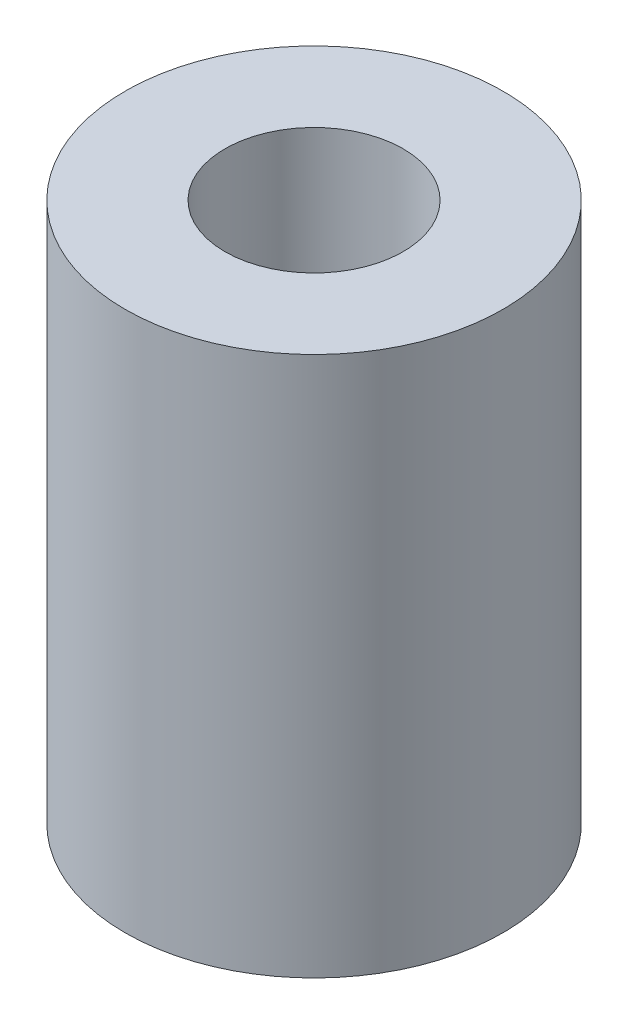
ISO-10303-21;
HEADER;
FILE_DESCRIPTION(('STEP AP214'),'2;1');
FILE_NAME('part.step','',(''),(''),'','','');
FILE_SCHEMA(('AUTOMOTIVE_DESIGN { 1 0 10303 214 1 1 1 1 }'));
ENDSEC;
DATA;
#1=APPLICATION_CONTEXT('core data for automotive mechanical design processes');
#2=APPLICATION_PROTOCOL_DEFINITION('international standard','automotive_design',2000,#1);
#3=PRODUCT_CONTEXT('',#1,'mechanical');
#4=PRODUCT('Part','Part','',(#3));
#5=PRODUCT_RELATED_PRODUCT_CATEGORY('part','',(#4));
#6=PRODUCT_DEFINITION_FORMATION('','',#4);
#7=PRODUCT_DEFINITION_CONTEXT('part definition',#1,'design');
#8=PRODUCT_DEFINITION('design','',#6,#7);
#9=PRODUCT_DEFINITION_SHAPE('','',#8);
#10=(LENGTH_UNIT() NAMED_UNIT(*) SI_UNIT(.MILLI.,.METRE.));
#11=(NAMED_UNIT(*) PLANE_ANGLE_UNIT() SI_UNIT($,.RADIAN.));
#12=(NAMED_UNIT(*) SI_UNIT($,.STERADIAN.) SOLID_ANGLE_UNIT());
#13=UNCERTAINTY_MEASURE_WITH_UNIT(LENGTH_MEASURE(1.E-05),#10,'distance_accuracy_value','');
#14=(GEOMETRIC_REPRESENTATION_CONTEXT(3) GLOBAL_UNCERTAINTY_ASSIGNED_CONTEXT((#13)) GLOBAL_UNIT_ASSIGNED_CONTEXT((#10,
#11,#12)) REPRESENTATION_CONTEXT('',''));
#15=CARTESIAN_POINT('',(0.,0.,0.));
#16=DIRECTION('',(0.,0.,1.));
#17=DIRECTION('',(1.,0.,0.));
#18=AXIS2_PLACEMENT_3D('',#15,#16,#17);
#19=CARTESIAN_POINT('',(0.,0.,0.));
#20=DIRECTION('',(0.,1.,0.));
#21=DIRECTION('',(0.,0.,1.));
#22=AXIS2_PLACEMENT_3D('',#19,#20,#21);
#23=PLANE('',#22);
#24=CARTESIAN_POINT('',(0.,0.,0.));
#25=DIRECTION('',(0.,1.,0.));
#26=DIRECTION('',(0.,0.,1.));
#27=AXIS2_PLACEMENT_3D('',#24,#25,#26);
#28=CIRCLE('',#27,7.);
#29=CARTESIAN_POINT('',(0.,0.,7.));
#30=VERTEX_POINT('',#29);
#31=EDGE_CURVE('E155',#30,#30,#28,.T.);
#32=ORIENTED_EDGE('',*,*,#31,.F.);
#33=EDGE_LOOP('',(#32));
#34=FACE_BOUND('',#33,.T.);
#35=CARTESIAN_POINT('',(0.,0.,0.));
#36=DIRECTION('',(0.,1.,0.));
#37=DIRECTION('',(0.,0.,1.));
#38=AXIS2_PLACEMENT_3D('',#35,#36,#37);
#39=CIRCLE('',#38,4.064);
#40=CARTESIAN_POINT('',(-3.06646490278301,0.,-2.667));
#41=VERTEX_POINT('',#40);
#42=CARTESIAN_POINT('',(3.06646490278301,0.,-2.667));
#43=VERTEX_POINT('',#42);
#44=EDGE_CURVE('E144',#41,#43,#39,.T.);
#45=ORIENTED_EDGE('',*,*,#44,.T.);
#46=DIRECTION('',(-1.,0.,0.));
#47=VECTOR('',#46,1.);
#48=CARTESIAN_POINT('',(-3.06646490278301,0.,-2.667));
#49=LINE('',#48,#47);
#50=EDGE_CURVE('E147',#43,#41,#49,.T.);
#51=ORIENTED_EDGE('',*,*,#50,.T.);
#52=EDGE_LOOP('',(#45,#51));
#53=FACE_BOUND('',#52,.T.);
#54=ADVANCED_FACE('F36',(#34,#53),#23,.F.);
#55=CARTESIAN_POINT('',(0.,10.,0.));
#56=DIRECTION('',(0.,-1.,0.));
#57=DIRECTION('',(0.,0.,-1.));
#58=AXIS2_PLACEMENT_3D('',#55,#56,#57);
#59=CYLINDRICAL_SURFACE('',#58,7.);
#60=ORIENTED_EDGE('',*,*,#31,.T.);
#61=EDGE_LOOP('',(#60));
#62=FACE_BOUND('',#61,.T.);
#63=CARTESIAN_POINT('',(0.,20.,0.));
#64=DIRECTION('',(0.,1.,0.));
#65=DIRECTION('',(0.,0.,1.));
#66=AXIS2_PLACEMENT_3D('',#63,#64,#65);
#67=CIRCLE('',#66,7.);
#68=CARTESIAN_POINT('',(0.,20.,7.));
#69=VERTEX_POINT('',#68);
#70=EDGE_CURVE('E244',#69,#69,#67,.T.);
#71=ORIENTED_EDGE('',*,*,#70,.F.);
#72=EDGE_LOOP('',(#71));
#73=FACE_BOUND('',#72,.T.);
#74=ADVANCED_FACE('F232',(#62,#73),#59,.T.);
#75=CARTESIAN_POINT('',(0.,10.,0.));
#76=DIRECTION('',(0.,-1.,0.));
#77=DIRECTION('',(0.,0.,-1.));
#78=AXIS2_PLACEMENT_3D('',#75,#76,#77);
#79=CYLINDRICAL_SURFACE('',#78,4.064);
#80=DIRECTION('',(0.,-1.,0.));
#81=VECTOR('',#80,1.);
#82=CARTESIAN_POINT('',(-3.06646490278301,10.,-2.667));
#83=LINE('',#82,#81);
#84=CARTESIAN_POINT('',(-3.06646490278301,8.,-2.667));
#85=VERTEX_POINT('',#84);
#86=EDGE_CURVE('E151',#85,#41,#83,.T.);
#87=ORIENTED_EDGE('',*,*,#86,.F.);
#88=CARTESIAN_POINT('',(0.,8.,0.));
#89=DIRECTION('',(0.,1.,0.));
#90=DIRECTION('',(0.,0.,1.));
#91=AXIS2_PLACEMENT_3D('',#88,#89,#90);
#92=CIRCLE('',#91,4.064);
#93=CARTESIAN_POINT('',(3.06646490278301,8.,-2.667));
#94=VERTEX_POINT('',#93);
#95=EDGE_CURVE('E166',#85,#94,#92,.T.);
#96=ORIENTED_EDGE('',*,*,#95,.T.);
#97=DIRECTION('',(0.,-1.,0.));
#98=VECTOR('',#97,1.);
#99=CARTESIAN_POINT('',(3.06646490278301,10.,-2.667));
#100=LINE('',#99,#98);
#101=EDGE_CURVE('E153',#94,#43,#100,.T.);
#102=ORIENTED_EDGE('',*,*,#101,.T.);
#103=ORIENTED_EDGE('',*,*,#44,.F.);
#104=EDGE_LOOP('',(#87,#96,#102,#103));
#105=FACE_BOUND('',#104,.T.);
#106=ADVANCED_FACE('F228',(#105),#79,.F.);
#107=CARTESIAN_POINT('',(-3.06646490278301,10.,-2.667));
#108=DIRECTION('',(0.,0.,1.));
#109=DIRECTION('',(1.,0.,0.));
#110=AXIS2_PLACEMENT_3D('',#107,#108,#109);
#111=PLANE('',#110);
#112=ORIENTED_EDGE('',*,*,#101,.F.);
#113=DIRECTION('',(-1.,0.,0.));
#114=VECTOR('',#113,1.);
#115=CARTESIAN_POINT('',(-3.06646490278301,8.,-2.667));
#116=LINE('',#115,#114);
#117=EDGE_CURVE('E158',#94,#85,#116,.T.);
#118=ORIENTED_EDGE('',*,*,#117,.T.);
#119=ORIENTED_EDGE('',*,*,#86,.T.);
#120=ORIENTED_EDGE('',*,*,#50,.F.);
#121=EDGE_LOOP('',(#112,#118,#119,#120));
#122=FACE_BOUND('',#121,.T.);
#123=ADVANCED_FACE('F224',(#122),#111,.T.);
#124=CARTESIAN_POINT('',(0.,10.,0.));
#125=DIRECTION('',(0.,1.,0.));
#126=DIRECTION('',(0.,0.,1.));
#127=AXIS2_PLACEMENT_3D('',#124,#125,#126);
#128=PLANE('',#127);
#129=CARTESIAN_POINT('',(0.,10.,0.));
#130=DIRECTION('',(0.,1.,0.));
#131=DIRECTION('',(0.,0.,1.));
#132=AXIS2_PLACEMENT_3D('',#129,#130,#131);
#133=CIRCLE('',#132,2.064);
#134=CARTESIAN_POINT('',(1.95325548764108,10.,-0.667));
#135=VERTEX_POINT('',#134);
#136=CARTESIAN_POINT('',(-1.95325548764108,10.,-0.667));
#137=VERTEX_POINT('',#136);
#138=EDGE_CURVE('E161',#135,#137,#133,.F.);
#139=ORIENTED_EDGE('',*,*,#138,.T.);
#140=DIRECTION('',(-1.,0.,0.));
#141=VECTOR('',#140,1.);
#142=CARTESIAN_POINT('',(0.,10.,-0.667));
#143=LINE('',#142,#141);
#144=EDGE_CURVE('E163',#137,#135,#143,.F.);
#145=ORIENTED_EDGE('',*,*,#144,.T.);
#146=EDGE_LOOP('',(#139,#145));
#147=FACE_BOUND('',#146,.T.);
#148=ADVANCED_FACE('F187',(#147),#128,.F.);
#149=CARTESIAN_POINT('',(0.,8.,0.));
#150=DIRECTION('',(0.,1.,0.));
#151=DIRECTION('',(0.,0.,1.));
#152=AXIS2_PLACEMENT_3D('',#149,#150,#151);
#153=TOROIDAL_SURFACE('',#152,2.064,2.);
#154=CARTESIAN_POINT('',(-3.06646490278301,8.,-2.667));
#155=CARTESIAN_POINT('',(-3.06646657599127,8.0523151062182,-2.66700760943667));
#156=CARTESIAN_POINT('',(-3.06552978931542,8.10462654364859,-2.6649474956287));
#157=CARTESIAN_POINT('',(-3.06179273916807,8.20885237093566,-2.65674995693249));
#158=CARTESIAN_POINT('',(-3.05899282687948,8.26076683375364,-2.65061330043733));
#159=CARTESIAN_POINT('',(-3.05155291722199,8.36369124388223,-2.63434254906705));
#160=CARTESIAN_POINT('',(-3.04691785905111,8.41470323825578,-2.62421918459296));
#161=CARTESIAN_POINT('',(-3.03583758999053,8.51558776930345,-2.60009682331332));
#162=CARTESIAN_POINT('',(-3.02939235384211,8.56546029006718,-2.58609777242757));
#163=CARTESIAN_POINT('',(-3.00738943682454,8.71282577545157,-2.53849792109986));
#164=CARTESIAN_POINT('',(-2.98915623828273,8.80818149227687,-2.49927595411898));
#165=CARTESIAN_POINT('',(-2.94594791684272,8.99051844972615,-2.40749307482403));
#166=CARTESIAN_POINT('',(-2.92097056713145,9.07749691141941,-2.35492775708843));
#167=CARTESIAN_POINT('',(-2.8639091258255,9.24358596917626,-2.23676810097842));
#168=CARTESIAN_POINT('',(-2.83164001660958,9.32239541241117,-2.17084025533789));
#169=CARTESIAN_POINT('',(-2.76098824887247,9.46768550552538,-2.02942010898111));
#170=CARTESIAN_POINT('',(-2.7226043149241,9.53416357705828,-1.95392581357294));
#171=CARTESIAN_POINT('',(-2.63699021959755,9.65868148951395,-1.78959729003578));
#172=CARTESIAN_POINT('',(-2.58929979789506,9.71563322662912,-1.70017988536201));
#173=CARTESIAN_POINT('',(-2.48802860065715,9.81379310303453,-1.51614575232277));
#174=CARTESIAN_POINT('',(-2.43444279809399,9.85498766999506,-1.42152462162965));
#175=CARTESIAN_POINT('',(-2.314625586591,9.92614291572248,-1.21755209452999));
#176=CARTESIAN_POINT('',(-2.24765597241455,9.95394490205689,-1.10788580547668));
#177=CARTESIAN_POINT('',(-2.10759174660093,9.99065077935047,-0.889563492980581));
#178=CARTESIAN_POINT('',(-2.03450784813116,9.99958703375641,-0.780906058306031));
#179=CARTESIAN_POINT('',(-1.95681961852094,9.99999535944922,-0.671986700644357));
#180=CARTESIAN_POINT('',(-1.95503832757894,10.0000000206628,-0.669492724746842));
#181=CARTESIAN_POINT('',(-1.95325548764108,10.,-0.667));
#182=B_SPLINE_CURVE_WITH_KNOTS('',3,(#154,#155,#156,#157,#158,#159,#160,#161,#162,#163,#164,
#165,#166,#167,#168,#169,#170,#171,#172,#173,#174,#175,#176,#177,#178,#179,#180,#181),
.UNSPECIFIED.,.F.,.F.,(4,2,2,2,2,2,2,2,2,2,2,2,2,4),(0.,0.156890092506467,0.313750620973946,
0.470191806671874,0.626635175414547,0.939176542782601,1.25182123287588,1.57352864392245,
1.89530324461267,2.24260991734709,2.59021507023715,2.98304213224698,3.37519476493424,
3.38438911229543),.UNSPECIFIED.);
#183=EDGE_CURVE('E138',#137,#85,#182,.F.);
#184=ORIENTED_EDGE('',*,*,#183,.F.);
#185=ORIENTED_EDGE('',*,*,#138,.F.);
#186=CARTESIAN_POINT('',(3.06646490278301,8.,-2.667));
#187=CARTESIAN_POINT('',(3.06646657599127,8.0523151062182,-2.66700760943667));
#188=CARTESIAN_POINT('',(3.06552978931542,8.10462654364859,-2.6649474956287));
#189=CARTESIAN_POINT('',(3.06179273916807,8.20885237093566,-2.65674995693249));
#190=CARTESIAN_POINT('',(3.05899282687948,8.26076683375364,-2.65061330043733));
#191=CARTESIAN_POINT('',(3.05155291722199,8.36369124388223,-2.63434254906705));
#192=CARTESIAN_POINT('',(3.04691785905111,8.41470323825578,-2.62421918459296));
#193=CARTESIAN_POINT('',(3.03583758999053,8.51558776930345,-2.60009682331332));
#194=CARTESIAN_POINT('',(3.02939235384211,8.56546029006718,-2.58609777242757));
#195=CARTESIAN_POINT('',(3.00738943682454,8.71282577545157,-2.53849792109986));
#196=CARTESIAN_POINT('',(2.98915623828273,8.80818149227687,-2.49927595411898));
#197=CARTESIAN_POINT('',(2.94594791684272,8.99051844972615,-2.40749307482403));
#198=CARTESIAN_POINT('',(2.92097056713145,9.07749691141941,-2.35492775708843));
#199=CARTESIAN_POINT('',(2.8639091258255,9.24358596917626,-2.23676810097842));
#200=CARTESIAN_POINT('',(2.83164001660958,9.32239541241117,-2.17084025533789));
#201=CARTESIAN_POINT('',(2.76098824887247,9.46768550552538,-2.02942010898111));
#202=CARTESIAN_POINT('',(2.7226043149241,9.53416357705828,-1.95392581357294));
#203=CARTESIAN_POINT('',(2.63699021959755,9.65868148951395,-1.78959729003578));
#204=CARTESIAN_POINT('',(2.58929979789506,9.71563322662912,-1.70017988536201));
#205=CARTESIAN_POINT('',(2.48802860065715,9.81379310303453,-1.51614575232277));
#206=CARTESIAN_POINT('',(2.43444279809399,9.85498766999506,-1.42152462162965));
#207=CARTESIAN_POINT('',(2.314625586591,9.92614291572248,-1.21755209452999));
#208=CARTESIAN_POINT('',(2.24765597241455,9.95394490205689,-1.10788580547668));
#209=CARTESIAN_POINT('',(2.10759174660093,9.99065077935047,-0.889563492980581));
#210=CARTESIAN_POINT('',(2.03450784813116,9.99958703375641,-0.780906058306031));
#211=CARTESIAN_POINT('',(1.95681961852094,9.99999535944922,-0.671986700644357));
#212=CARTESIAN_POINT('',(1.95503832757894,10.0000000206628,-0.669492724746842));
#213=CARTESIAN_POINT('',(1.95325548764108,10.,-0.667));
#214=B_SPLINE_CURVE_WITH_KNOTS('',3,(#186,#187,#188,#189,#190,#191,#192,#193,#194,#195,#196,
#197,#198,#199,#200,#201,#202,#203,#204,#205,#206,#207,#208,#209,#210,#211,#212,#213),
.UNSPECIFIED.,.F.,.F.,(4,2,2,2,2,2,2,2,2,2,2,2,2,4),(0.,0.156890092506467,0.313750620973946,
0.470191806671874,0.626635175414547,0.939176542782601,1.25182123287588,1.57352864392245,
1.89530324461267,2.24260991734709,2.59021507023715,2.98304213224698,3.37519476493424,
3.38438911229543),.UNSPECIFIED.);
#215=EDGE_CURVE('E148',#94,#135,#214,.T.);
#216=ORIENTED_EDGE('',*,*,#215,.F.);
#217=ORIENTED_EDGE('',*,*,#95,.F.);
#218=EDGE_LOOP('',(#184,#185,#216,#217));
#219=FACE_BOUND('',#218,.T.);
#220=ADVANCED_FACE('F184',(#219),#153,.F.);
#221=CARTESIAN_POINT('',(-3.06646490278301,8.,-0.667));
#222=DIRECTION('',(-1.,0.,0.));
#223=DIRECTION('',(0.,0.,1.));
#224=AXIS2_PLACEMENT_3D('',#221,#222,#223);
#225=CYLINDRICAL_SURFACE('',#224,2.);
#226=ORIENTED_EDGE('',*,*,#215,.T.);
#227=ORIENTED_EDGE('',*,*,#144,.F.);
#228=ORIENTED_EDGE('',*,*,#183,.T.);
#229=ORIENTED_EDGE('',*,*,#117,.F.);
#230=EDGE_LOOP('',(#226,#227,#228,#229));
#231=FACE_BOUND('',#230,.T.);
#232=ADVANCED_FACE('F181',(#231),#225,.F.);
#233=CARTESIAN_POINT('',(0.,20.,0.));
#234=DIRECTION('',(0.,-1.,0.));
#235=DIRECTION('',(0.,0.,-1.));
#236=AXIS2_PLACEMENT_3D('',#233,#234,#235);
#237=CYLINDRICAL_SURFACE('',#236,3.302);
#238=CARTESIAN_POINT('',(0.,20.,0.));
#239=DIRECTION('',(0.,1.,0.));
#240=DIRECTION('',(0.,0.,1.));
#241=AXIS2_PLACEMENT_3D('',#238,#239,#240);
#242=CIRCLE('',#241,3.302);
#243=CARTESIAN_POINT('',(0.,20.,3.302));
#244=VERTEX_POINT('',#243);
#245=EDGE_CURVE('E247',#244,#244,#242,.T.);
#246=ORIENTED_EDGE('',*,*,#245,.T.);
#247=EDGE_LOOP('',(#246));
#248=FACE_BOUND('',#247,.T.);
#249=DIRECTION('',(0.,-1.,0.));
#250=VECTOR('',#249,1.);
#251=CARTESIAN_POINT('',(3.29407741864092,13.6,0.2286));
#252=LINE('',#251,#250);
#253=CARTESIAN_POINT('',(3.29407741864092,13.6,0.2286));
#254=VERTEX_POINT('',#253);
#255=CARTESIAN_POINT('',(3.29407741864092,12.2,0.2286));
#256=VERTEX_POINT('',#255);
#257=EDGE_CURVE('E117',#254,#256,#252,.T.);
#258=ORIENTED_EDGE('',*,*,#257,.T.);
#259=CARTESIAN_POINT('',(0.,12.2,0.));
#260=DIRECTION('',(0.,1.,0.));
#261=DIRECTION('',(0.,0.,1.));
#262=AXIS2_PLACEMENT_3D('',#259,#260,#261);
#263=CIRCLE('',#262,3.302);
#264=CARTESIAN_POINT('',(-3.29407741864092,12.2,0.2286));
#265=VERTEX_POINT('',#264);
#266=EDGE_CURVE('E258',#256,#265,#263,.F.);
#267=ORIENTED_EDGE('',*,*,#266,.T.);
#268=DIRECTION('',(0.,-1.,0.));
#269=VECTOR('',#268,1.);
#270=CARTESIAN_POINT('',(-3.29407741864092,13.6,0.2286));
#271=LINE('',#270,#269);
#272=CARTESIAN_POINT('',(-3.29407741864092,13.6,0.2286));
#273=VERTEX_POINT('',#272);
#274=EDGE_CURVE('E136',#273,#265,#271,.T.);
#275=ORIENTED_EDGE('',*,*,#274,.F.);
#276=CARTESIAN_POINT('',(0.,13.6,0.));
#277=DIRECTION('',(0.,1.,0.));
#278=DIRECTION('',(0.,0.,1.));
#279=AXIS2_PLACEMENT_3D('',#276,#277,#278);
#280=CIRCLE('',#279,3.302);
#281=CARTESIAN_POINT('',(-3.29407741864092,13.6,-0.2286));
#282=VERTEX_POINT('',#281);
#283=EDGE_CURVE('E129',#282,#273,#280,.T.);
#284=ORIENTED_EDGE('',*,*,#283,.F.);
#285=DIRECTION('',(0.,-1.,0.));
#286=VECTOR('',#285,1.);
#287=CARTESIAN_POINT('',(-3.29407741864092,13.6,-0.2286));
#288=LINE('',#287,#286);
#289=CARTESIAN_POINT('',(-3.29407741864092,12.2,-0.2286));
#290=VERTEX_POINT('',#289);
#291=EDGE_CURVE('E140',#282,#290,#288,.T.);
#292=ORIENTED_EDGE('',*,*,#291,.T.);
#293=CARTESIAN_POINT('',(0.,12.2,0.));
#294=DIRECTION('',(0.,1.,0.));
#295=DIRECTION('',(0.,0.,1.));
#296=AXIS2_PLACEMENT_3D('',#293,#294,#295);
#297=CIRCLE('',#296,3.302);
#298=CARTESIAN_POINT('',(3.29407741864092,12.2,-0.2286));
#299=VERTEX_POINT('',#298);
#300=EDGE_CURVE('E209',#290,#299,#297,.F.);
#301=ORIENTED_EDGE('',*,*,#300,.T.);
#302=DIRECTION('',(0.,-1.,0.));
#303=VECTOR('',#302,1.);
#304=CARTESIAN_POINT('',(3.29407741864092,13.6,-0.2286));
#305=LINE('',#304,#303);
#306=CARTESIAN_POINT('',(3.29407741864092,13.6,-0.2286));
#307=VERTEX_POINT('',#306);
#308=EDGE_CURVE('E119',#307,#299,#305,.T.);
#309=ORIENTED_EDGE('',*,*,#308,.F.);
#310=CARTESIAN_POINT('',(0.,13.6,0.));
#311=DIRECTION('',(0.,1.,0.));
#312=DIRECTION('',(0.,0.,1.));
#313=AXIS2_PLACEMENT_3D('',#310,#311,#312);
#314=CIRCLE('',#313,3.302);
#315=EDGE_CURVE('E113',#254,#307,#314,.T.);
#316=ORIENTED_EDGE('',*,*,#315,.F.);
#317=EDGE_LOOP('',(#258,#267,#275,#284,#292,#301,#309,#316));
#318=FACE_BOUND('',#317,.T.);
#319=ADVANCED_FACE('F115',(#248,#318),#237,.F.);
#320=CARTESIAN_POINT('',(0.,20.,0.));
#321=DIRECTION('',(0.,1.,0.));
#322=DIRECTION('',(0.,0.,1.));
#323=AXIS2_PLACEMENT_3D('',#320,#321,#322);
#324=PLANE('',#323);
#325=ORIENTED_EDGE('',*,*,#70,.T.);
#326=EDGE_LOOP('',(#325));
#327=FACE_BOUND('',#326,.T.);
#328=ORIENTED_EDGE('',*,*,#245,.F.);
#329=EDGE_LOOP('',(#328));
#330=FACE_BOUND('',#329,.T.);
#331=ADVANCED_FACE('F269',(#327,#330),#324,.T.);
#332=CARTESIAN_POINT('',(0.,13.6,0.));
#333=DIRECTION('',(0.,1.,0.));
#334=DIRECTION('',(0.,0.,1.));
#335=AXIS2_PLACEMENT_3D('',#332,#333,#334);
#336=PLANE('',#335);
#337=ORIENTED_EDGE('',*,*,#283,.T.);
#338=DIRECTION('',(1.,0.,0.));
#339=VECTOR('',#338,1.);
#340=CARTESIAN_POINT('',(-3.29407741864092,13.6,0.2286));
#341=LINE('',#340,#339);
#342=EDGE_CURVE('E124',#273,#254,#341,.T.);
#343=ORIENTED_EDGE('',*,*,#342,.T.);
#344=ORIENTED_EDGE('',*,*,#315,.T.);
#345=DIRECTION('',(-1.,0.,0.));
#346=VECTOR('',#345,1.);
#347=CARTESIAN_POINT('',(-3.29407741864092,13.6,-0.2286));
#348=LINE('',#347,#346);
#349=EDGE_CURVE('E123',#307,#282,#348,.T.);
#350=ORIENTED_EDGE('',*,*,#349,.T.);
#351=EDGE_LOOP('',(#337,#343,#344,#350));
#352=FACE_BOUND('',#351,.T.);
#353=ADVANCED_FACE('F128',(#352),#336,.T.);
#354=CARTESIAN_POINT('',(-3.29407741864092,13.6,-0.2286));
#355=DIRECTION('',(0.,0.,1.));
#356=DIRECTION('',(1.,0.,0.));
#357=AXIS2_PLACEMENT_3D('',#354,#355,#356);
#358=PLANE('',#357);
#359=DIRECTION('',(-1.,0.,0.));
#360=VECTOR('',#359,1.);
#361=CARTESIAN_POINT('',(-3.29407741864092,12.,-0.2286));
#362=LINE('',#361,#360);
#363=CARTESIAN_POINT('',(3.09356526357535,12.,-0.2286));
#364=VERTEX_POINT('',#363);
#365=CARTESIAN_POINT('',(-3.09356526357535,12.,-0.2286));
#366=VERTEX_POINT('',#365);
#367=EDGE_CURVE('E249',#364,#366,#362,.T.);
#368=ORIENTED_EDGE('',*,*,#367,.T.);
#369=CARTESIAN_POINT('',(-3.09356526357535,12.,-0.2286));
#370=CARTESIAN_POINT('',(-3.10486746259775,11.9999905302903,-0.2286));
#371=CARTESIAN_POINT('',(-3.11616703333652,12.0009522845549,-0.2286));
#372=CARTESIAN_POINT('',(-3.13843920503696,12.0047489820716,-0.2286));
#373=CARTESIAN_POINT('',(-3.14941202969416,12.0075826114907,-0.2286));
#374=CARTESIAN_POINT('',(-3.17073119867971,12.0150558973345,-0.2286));
#375=CARTESIAN_POINT('',(-3.18107721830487,12.0196964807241,-0.2286));
#376=CARTESIAN_POINT('',(-3.2008400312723,12.0306494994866,-0.2286));
#377=CARTESIAN_POINT('',(-3.21025701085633,12.0369615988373,-0.2286));
#378=CARTESIAN_POINT('',(-3.22788245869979,12.0510713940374,-0.2286));
#379=CARTESIAN_POINT('',(-3.23609252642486,12.0588670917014,-0.2286));
#380=CARTESIAN_POINT('',(-3.25108513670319,12.075731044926,-0.2286));
#381=CARTESIAN_POINT('',(-3.25786740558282,12.0847995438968,-0.2286));
#382=CARTESIAN_POINT('',(-3.26979318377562,12.1039272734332,-0.2286));
#383=CARTESIAN_POINT('',(-3.2749403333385,12.1139842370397,-0.2286));
#384=CARTESIAN_POINT('',(-3.28346625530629,12.1348187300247,-0.2286));
#385=CARTESIAN_POINT('',(-3.28684612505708,12.1455958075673,-0.2286));
#386=CARTESIAN_POINT('',(-3.29088397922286,12.1637012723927,-0.2286));
#387=CARTESIAN_POINT('',(-3.29208080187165,12.1709140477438,-0.2286));
#388=CARTESIAN_POINT('',(-3.29367739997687,12.1854168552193,-0.2286));
#389=CARTESIAN_POINT('',(-3.29407830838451,12.192706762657,-0.2286));
#390=CARTESIAN_POINT('',(-3.29407741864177,12.1999999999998,-0.2286));
#391=B_SPLINE_CURVE_WITH_KNOTS('',3,(#369,#370,#371,#372,#373,#374,#375,#376,#377,#378,#379,
#380,#381,#382,#383,#384,#385,#386,#387,#388,#389,#390),.UNSPECIFIED.,.F.,.F.,(4,2,2,2,2,2,2,2,
2,2,4),(0.,0.0338620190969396,0.0677002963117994,0.101555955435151,0.135404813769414,
0.169208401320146,0.203018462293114,0.236752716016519,0.270465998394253,0.292359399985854,
0.31422161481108),.UNSPECIFIED.);
#392=EDGE_CURVE('E11',#366,#290,#391,.T.);
#393=ORIENTED_EDGE('',*,*,#392,.T.);
#394=ORIENTED_EDGE('',*,*,#291,.F.);
#395=ORIENTED_EDGE('',*,*,#349,.F.);
#396=ORIENTED_EDGE('',*,*,#308,.T.);
#397=CARTESIAN_POINT('',(3.29407741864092,12.2,-0.2286));
#398=CARTESIAN_POINT('',(3.29408708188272,12.1887682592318,-0.2286));
#399=CARTESIAN_POINT('',(3.29312958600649,12.1775395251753,-0.2286));
#400=CARTESIAN_POINT('',(3.28935176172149,12.1554093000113,-0.2286));
#401=CARTESIAN_POINT('',(3.28653301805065,12.1445075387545,-0.2286));
#402=CARTESIAN_POINT('',(3.27910225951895,12.1233274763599,-0.2286));
#403=CARTESIAN_POINT('',(3.27448942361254,12.1130494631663,-0.2286));
#404=CARTESIAN_POINT('',(3.26360677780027,12.0934141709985,-0.2286));
#405=CARTESIAN_POINT('',(3.25733722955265,12.0840567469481,-0.2286));
#406=CARTESIAN_POINT('',(3.24331210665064,12.0665155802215,-0.2286));
#407=CARTESIAN_POINT('',(3.2355550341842,12.0583330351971,-0.2286));
#408=CARTESIAN_POINT('',(3.21877833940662,12.0433811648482,-0.2286));
#409=CARTESIAN_POINT('',(3.20975846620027,12.0366121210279,-0.2286));
#410=CARTESIAN_POINT('',(3.19069082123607,12.0246637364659,-0.2286));
#411=CARTESIAN_POINT('',(3.18064055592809,12.019488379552,-0.2286));
#412=CARTESIAN_POINT('',(3.15981707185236,12.0108964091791,-0.2286));
#413=CARTESIAN_POINT('',(3.1490442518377,12.0074788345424,-0.2286));
#414=CARTESIAN_POINT('',(3.13076790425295,12.0033295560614,-0.2286));
#415=CARTESIAN_POINT('',(3.1233773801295,12.0020816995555,-0.2286));
#416=CARTESIAN_POINT('',(3.10851399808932,12.0004170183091,-0.2286));
#417=CARTESIAN_POINT('',(3.10104127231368,11.9999990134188,-0.2286));
#418=CARTESIAN_POINT('',(3.09356526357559,11.9999999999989,-0.2286));
#419=B_SPLINE_CURVE_WITH_KNOTS('',3,(#397,#398,#399,#400,#401,#402,#403,#404,#405,#406,#407,
#408,#409,#410,#411,#412,#413,#414,#415,#416,#417,#418),.UNSPECIFIED.,.F.,.F.,(4,2,2,2,2,2,2,2,
2,2,4),(0.,0.0336501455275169,0.0672716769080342,0.100908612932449,0.134540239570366,
0.168205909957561,0.201878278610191,0.235634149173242,0.269371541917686,0.291813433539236,
0.314223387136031),.UNSPECIFIED.);
#420=EDGE_CURVE('E50',#299,#364,#419,.T.);
#421=ORIENTED_EDGE('',*,*,#420,.T.);
#422=EDGE_LOOP('',(#368,#393,#394,#395,#396,#421));
#423=FACE_BOUND('',#422,.T.);
#424=ADVANCED_FACE('F215',(#423),#358,.F.);
#425=CARTESIAN_POINT('',(-3.29407741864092,13.6,0.2286));
#426=DIRECTION('',(0.,0.,-1.));
#427=DIRECTION('',(-1.,0.,0.));
#428=AXIS2_PLACEMENT_3D('',#425,#426,#427);
#429=PLANE('',#428);
#430=DIRECTION('',(1.,0.,0.));
#431=VECTOR('',#430,1.);
#432=CARTESIAN_POINT('',(-3.29407741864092,12.,0.2286));
#433=LINE('',#432,#431);
#434=CARTESIAN_POINT('',(-3.09356526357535,12.,0.2286));
#435=VERTEX_POINT('',#434);
#436=CARTESIAN_POINT('',(3.09356526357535,12.,0.2286));
#437=VERTEX_POINT('',#436);
#438=EDGE_CURVE('E246',#435,#437,#433,.T.);
#439=ORIENTED_EDGE('',*,*,#438,.T.);
#440=CARTESIAN_POINT('',(3.09356526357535,12.,0.2286));
#441=CARTESIAN_POINT('',(3.10486746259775,11.9999905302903,0.2286));
#442=CARTESIAN_POINT('',(3.11616703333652,12.0009522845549,0.2286));
#443=CARTESIAN_POINT('',(3.13843920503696,12.0047489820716,0.2286));
#444=CARTESIAN_POINT('',(3.14941202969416,12.0075826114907,0.2286));
#445=CARTESIAN_POINT('',(3.17073119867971,12.0150558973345,0.2286));
#446=CARTESIAN_POINT('',(3.18107721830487,12.0196964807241,0.2286));
#447=CARTESIAN_POINT('',(3.2008400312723,12.0306494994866,0.2286));
#448=CARTESIAN_POINT('',(3.21025701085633,12.0369615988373,0.2286));
#449=CARTESIAN_POINT('',(3.22788245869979,12.0510713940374,0.2286));
#450=CARTESIAN_POINT('',(3.23609252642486,12.0588670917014,0.2286));
#451=CARTESIAN_POINT('',(3.25108513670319,12.075731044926,0.2286));
#452=CARTESIAN_POINT('',(3.25786740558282,12.0847995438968,0.2286));
#453=CARTESIAN_POINT('',(3.26979318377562,12.1039272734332,0.2286));
#454=CARTESIAN_POINT('',(3.2749403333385,12.1139842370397,0.2286));
#455=CARTESIAN_POINT('',(3.28346625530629,12.1348187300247,0.2286));
#456=CARTESIAN_POINT('',(3.28684612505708,12.1455958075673,0.2286));
#457=CARTESIAN_POINT('',(3.29088397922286,12.1637012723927,0.2286));
#458=CARTESIAN_POINT('',(3.29208080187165,12.1709140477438,0.2286));
#459=CARTESIAN_POINT('',(3.29367739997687,12.1854168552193,0.2286));
#460=CARTESIAN_POINT('',(3.29407830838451,12.192706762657,0.2286));
#461=CARTESIAN_POINT('',(3.29407741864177,12.1999999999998,0.2286));
#462=B_SPLINE_CURVE_WITH_KNOTS('',3,(#440,#441,#442,#443,#444,#445,#446,#447,#448,#449,#450,
#451,#452,#453,#454,#455,#456,#457,#458,#459,#460,#461),.UNSPECIFIED.,.F.,.F.,(4,2,2,2,2,2,2,2,
2,2,4),(0.,0.0338620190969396,0.0677002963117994,0.101555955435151,0.135404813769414,
0.169208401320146,0.203018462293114,0.236752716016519,0.270465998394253,0.292359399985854,
0.31422161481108),.UNSPECIFIED.);
#463=EDGE_CURVE('E135',#437,#256,#462,.T.);
#464=ORIENTED_EDGE('',*,*,#463,.T.);
#465=ORIENTED_EDGE('',*,*,#257,.F.);
#466=ORIENTED_EDGE('',*,*,#342,.F.);
#467=ORIENTED_EDGE('',*,*,#274,.T.);
#468=CARTESIAN_POINT('',(-3.29407741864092,12.2,0.2286));
#469=CARTESIAN_POINT('',(-3.29408708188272,12.1887682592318,0.2286));
#470=CARTESIAN_POINT('',(-3.29312958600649,12.1775395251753,0.2286));
#471=CARTESIAN_POINT('',(-3.28935176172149,12.1554093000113,0.2286));
#472=CARTESIAN_POINT('',(-3.28653301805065,12.1445075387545,0.2286));
#473=CARTESIAN_POINT('',(-3.27910225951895,12.1233274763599,0.2286));
#474=CARTESIAN_POINT('',(-3.27448942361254,12.1130494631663,0.2286));
#475=CARTESIAN_POINT('',(-3.26360677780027,12.0934141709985,0.2286));
#476=CARTESIAN_POINT('',(-3.25733722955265,12.0840567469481,0.2286));
#477=CARTESIAN_POINT('',(-3.24331210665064,12.0665155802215,0.2286));
#478=CARTESIAN_POINT('',(-3.2355550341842,12.0583330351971,0.2286));
#479=CARTESIAN_POINT('',(-3.21877833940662,12.0433811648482,0.2286));
#480=CARTESIAN_POINT('',(-3.20975846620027,12.0366121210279,0.2286));
#481=CARTESIAN_POINT('',(-3.19069082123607,12.0246637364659,0.2286));
#482=CARTESIAN_POINT('',(-3.18064055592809,12.019488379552,0.2286));
#483=CARTESIAN_POINT('',(-3.15981707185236,12.0108964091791,0.2286));
#484=CARTESIAN_POINT('',(-3.1490442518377,12.0074788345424,0.2286));
#485=CARTESIAN_POINT('',(-3.13076790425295,12.0033295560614,0.2286));
#486=CARTESIAN_POINT('',(-3.1233773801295,12.0020816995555,0.2286));
#487=CARTESIAN_POINT('',(-3.10851399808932,12.0004170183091,0.2286));
#488=CARTESIAN_POINT('',(-3.10104127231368,11.9999990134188,0.2286));
#489=CARTESIAN_POINT('',(-3.09356526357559,11.9999999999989,0.2286));
#490=B_SPLINE_CURVE_WITH_KNOTS('',3,(#468,#469,#470,#471,#472,#473,#474,#475,#476,#477,#478,
#479,#480,#481,#482,#483,#484,#485,#486,#487,#488,#489),.UNSPECIFIED.,.F.,.F.,(4,2,2,2,2,2,2,2,
2,2,4),(0.,0.0336501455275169,0.0672716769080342,0.100908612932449,0.134540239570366,
0.168205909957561,0.201878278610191,0.235634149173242,0.269371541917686,0.291813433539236,
0.314223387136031),.UNSPECIFIED.);
#491=EDGE_CURVE('E197',#265,#435,#490,.T.);
#492=ORIENTED_EDGE('',*,*,#491,.T.);
#493=EDGE_LOOP('',(#439,#464,#465,#466,#467,#492));
#494=FACE_BOUND('',#493,.T.);
#495=ADVANCED_FACE('F134',(#494),#429,.F.);
#496=CARTESIAN_POINT('',(0.,12.,0.));
#497=DIRECTION('',(0.,1.,0.));
#498=DIRECTION('',(0.,0.,1.));
#499=AXIS2_PLACEMENT_3D('',#496,#497,#498);
#500=PLANE('',#499);
#501=ORIENTED_EDGE('',*,*,#438,.F.);
#502=CARTESIAN_POINT('',(0.,12.,0.));
#503=DIRECTION('',(0.,1.,0.));
#504=DIRECTION('',(0.,0.,1.));
#505=AXIS2_PLACEMENT_3D('',#502,#503,#504);
#506=CIRCLE('',#505,3.102);
#507=EDGE_CURVE('E168',#435,#437,#506,.T.);
#508=ORIENTED_EDGE('',*,*,#507,.T.);
#509=EDGE_LOOP('',(#501,#508));
#510=FACE_BOUND('',#509,.T.);
#511=ADVANCED_FACE('F214',(#510),#500,.T.);
#512=ORIENTED_EDGE('',*,*,#367,.F.);
#513=CARTESIAN_POINT('',(0.,12.,0.));
#514=DIRECTION('',(0.,1.,0.));
#515=DIRECTION('',(0.,0.,1.));
#516=AXIS2_PLACEMENT_3D('',#513,#514,#515);
#517=CIRCLE('',#516,3.102);
#518=EDGE_CURVE('E259',#364,#366,#517,.T.);
#519=ORIENTED_EDGE('',*,*,#518,.T.);
#520=EDGE_LOOP('',(#512,#519));
#521=FACE_BOUND('',#520,.T.);
#522=ADVANCED_FACE('F193',(#521),#500,.T.);
#523=CARTESIAN_POINT('',(0.,12.2,0.));
#524=DIRECTION('',(0.,1.,0.));
#525=DIRECTION('',(0.,0.,1.));
#526=AXIS2_PLACEMENT_3D('',#523,#524,#525);
#527=TOROIDAL_SURFACE('',#526,3.102,0.2);
#528=ORIENTED_EDGE('',*,*,#491,.F.);
#529=ORIENTED_EDGE('',*,*,#266,.F.);
#530=ORIENTED_EDGE('',*,*,#463,.F.);
#531=ORIENTED_EDGE('',*,*,#507,.F.);
#532=EDGE_LOOP('',(#528,#529,#530,#531));
#533=FACE_BOUND('',#532,.T.);
#534=ADVANCED_FACE('F189',(#533),#527,.F.);
#535=CARTESIAN_POINT('',(0.,12.2,0.));
#536=DIRECTION('',(0.,1.,0.));
#537=DIRECTION('',(0.,0.,1.));
#538=AXIS2_PLACEMENT_3D('',#535,#536,#537);
#539=TOROIDAL_SURFACE('',#538,3.102,0.2);
#540=ORIENTED_EDGE('',*,*,#420,.F.);
#541=ORIENTED_EDGE('',*,*,#300,.F.);
#542=ORIENTED_EDGE('',*,*,#392,.F.);
#543=ORIENTED_EDGE('',*,*,#518,.F.);
#544=EDGE_LOOP('',(#540,#541,#542,#543));
#545=FACE_BOUND('',#544,.T.);
#546=ADVANCED_FACE('F38',(#545),#539,.F.);
#547=CLOSED_SHELL('',(#54,#74,#106,#123,#148,#220,#232,#319,#331,#353,#424,#495,#511,#522,#534,#546));
#548=MANIFOLD_SOLID_BREP('B2',#547);
#549=ADVANCED_BREP_SHAPE_REPRESENTATION('',(#18,#548),#14);
#550=SHAPE_DEFINITION_REPRESENTATION(#9,#549);
ENDSEC;
END-ISO-10303-21;
